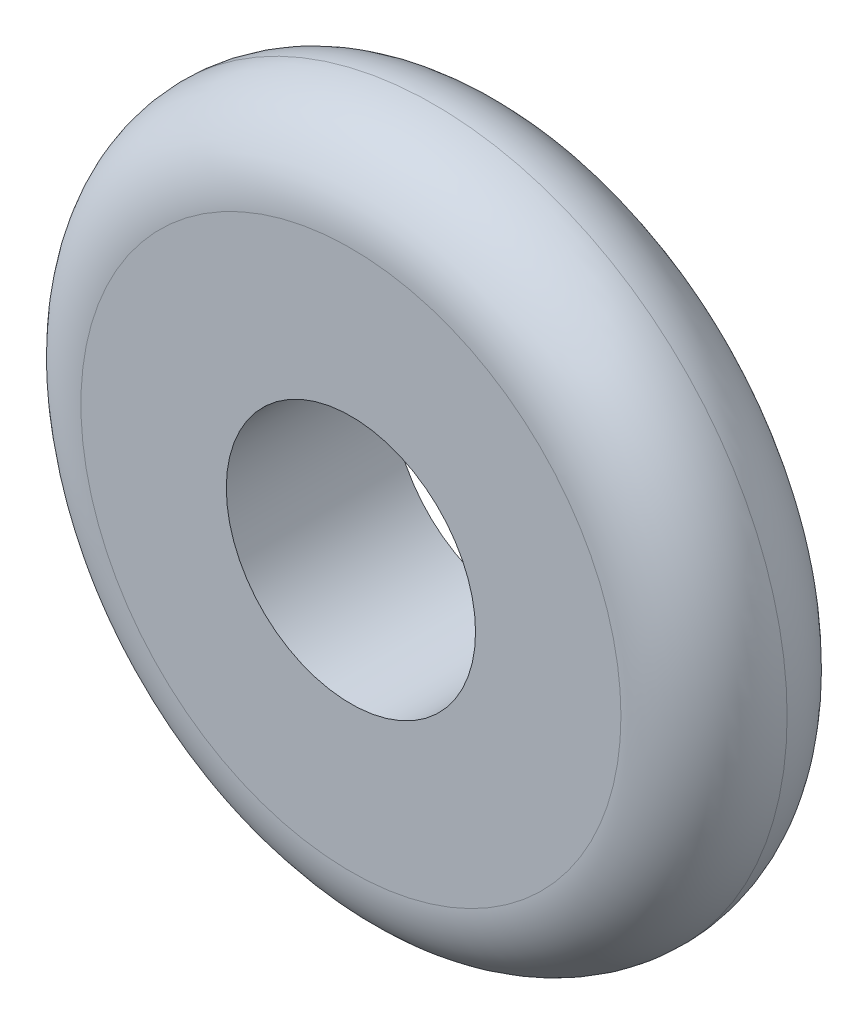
ISO-10303-21;
HEADER;
FILE_DESCRIPTION(('STEP AP214'),'2;1');
FILE_NAME('part.step','',(''),(''),'','','');
FILE_SCHEMA(('AUTOMOTIVE_DESIGN { 1 0 10303 214 1 1 1 1 }'));
ENDSEC;
DATA;
#1=APPLICATION_CONTEXT('core data for automotive mechanical design processes');
#2=APPLICATION_PROTOCOL_DEFINITION('international standard','automotive_design',2000,#1);
#3=PRODUCT_CONTEXT('',#1,'mechanical');
#4=PRODUCT('Part','Part','',(#3));
#5=PRODUCT_RELATED_PRODUCT_CATEGORY('part','',(#4));
#6=PRODUCT_DEFINITION_FORMATION('','',#4);
#7=PRODUCT_DEFINITION_CONTEXT('part definition',#1,'design');
#8=PRODUCT_DEFINITION('design','',#6,#7);
#9=PRODUCT_DEFINITION_SHAPE('','',#8);
#10=(LENGTH_UNIT() NAMED_UNIT(*) SI_UNIT(.MILLI.,.METRE.));
#11=(NAMED_UNIT(*) PLANE_ANGLE_UNIT() SI_UNIT($,.RADIAN.));
#12=(NAMED_UNIT(*) SI_UNIT($,.STERADIAN.) SOLID_ANGLE_UNIT());
#13=UNCERTAINTY_MEASURE_WITH_UNIT(LENGTH_MEASURE(1.E-05),#10,'distance_accuracy_value','');
#14=(GEOMETRIC_REPRESENTATION_CONTEXT(3) GLOBAL_UNCERTAINTY_ASSIGNED_CONTEXT((#13)) GLOBAL_UNIT_ASSIGNED_CONTEXT((#10,
#11,#12)) REPRESENTATION_CONTEXT('',''));
#15=CARTESIAN_POINT('',(0.,0.,0.));
#16=DIRECTION('',(0.,0.,1.));
#17=DIRECTION('',(1.,0.,0.));
#18=AXIS2_PLACEMENT_3D('',#15,#16,#17);
#19=CARTESIAN_POINT('',(0.,0.,4.));
#20=DIRECTION('',(0.,0.,1.));
#21=DIRECTION('',(1.,0.,0.));
#22=AXIS2_PLACEMENT_3D('',#19,#20,#21);
#23=PLANE('',#22);
#24=CARTESIAN_POINT('',(0.,0.,4.));
#25=DIRECTION('',(0.,0.,1.));
#26=DIRECTION('',(1.,0.,0.));
#27=AXIS2_PLACEMENT_3D('',#24,#25,#26);
#28=CIRCLE('',#27,6.5);
#29=CARTESIAN_POINT('',(6.5,0.,4.));
#30=VERTEX_POINT('',#29);
#31=EDGE_CURVE('E10',#30,#30,#28,.T.);
#32=ORIENTED_EDGE('',*,*,#31,.T.);
#33=EDGE_LOOP('',(#32));
#34=FACE_BOUND('',#33,.T.);
#35=CARTESIAN_POINT('',(0.,0.,4.));
#36=DIRECTION('',(0.,0.,1.));
#37=DIRECTION('',(1.,0.,0.));
#38=AXIS2_PLACEMENT_3D('',#35,#36,#37);
#39=CIRCLE('',#38,3.);
#40=CARTESIAN_POINT('',(3.,0.,4.));
#41=VERTEX_POINT('',#40);
#42=EDGE_CURVE('E41',#41,#41,#39,.T.);
#43=ORIENTED_EDGE('',*,*,#42,.F.);
#44=EDGE_LOOP('',(#43));
#45=FACE_BOUND('',#44,.T.);
#46=ADVANCED_FACE('F29',(#34,#45),#23,.T.);
#47=CARTESIAN_POINT('',(0.,0.,0.));
#48=DIRECTION('',(0.,0.,1.));
#49=DIRECTION('',(1.,0.,0.));
#50=AXIS2_PLACEMENT_3D('',#47,#48,#49);
#51=PLANE('',#50);
#52=CARTESIAN_POINT('',(0.,0.,0.));
#53=DIRECTION('',(0.,0.,1.));
#54=DIRECTION('',(1.,0.,0.));
#55=AXIS2_PLACEMENT_3D('',#52,#53,#54);
#56=CIRCLE('',#55,6.5);
#57=CARTESIAN_POINT('',(6.5,0.,0.));
#58=VERTEX_POINT('',#57);
#59=EDGE_CURVE('E37',#58,#58,#56,.F.);
#60=ORIENTED_EDGE('',*,*,#59,.T.);
#61=EDGE_LOOP('',(#60));
#62=FACE_BOUND('',#61,.T.);
#63=CARTESIAN_POINT('',(0.,0.,0.));
#64=DIRECTION('',(0.,0.,1.));
#65=DIRECTION('',(1.,0.,0.));
#66=AXIS2_PLACEMENT_3D('',#63,#64,#65);
#67=CIRCLE('',#66,3.);
#68=CARTESIAN_POINT('',(3.,0.,0.));
#69=VERTEX_POINT('',#68);
#70=EDGE_CURVE('E44',#69,#69,#67,.T.);
#71=ORIENTED_EDGE('',*,*,#70,.T.);
#72=EDGE_LOOP('',(#71));
#73=FACE_BOUND('',#72,.T.);
#74=ADVANCED_FACE('F54',(#62,#73),#51,.F.);
#75=CARTESIAN_POINT('',(0.,0.,4.));
#76=DIRECTION('',(0.,0.,-1.));
#77=DIRECTION('',(-1.,0.,0.));
#78=AXIS2_PLACEMENT_3D('',#75,#76,#77);
#79=CYLINDRICAL_SURFACE('',#78,3.);
#80=ORIENTED_EDGE('',*,*,#42,.T.);
#81=EDGE_LOOP('',(#80));
#82=FACE_BOUND('',#81,.T.);
#83=ORIENTED_EDGE('',*,*,#70,.F.);
#84=EDGE_LOOP('',(#83));
#85=FACE_BOUND('',#84,.T.);
#86=ADVANCED_FACE('F50',(#82,#85),#79,.F.);
#87=CARTESIAN_POINT('',(0.,0.,2.));
#88=DIRECTION('',(0.,0.,1.));
#89=DIRECTION('',(1.,0.,0.));
#90=AXIS2_PLACEMENT_3D('',#87,#88,#89);
#91=TOROIDAL_SURFACE('',#90,6.5,2.);
#92=ORIENTED_EDGE('',*,*,#31,.F.);
#93=EDGE_LOOP('',(#92));
#94=FACE_BOUND('',#93,.T.);
#95=CARTESIAN_POINT('',(0.,0.,2.));
#96=DIRECTION('',(0.,0.,1.));
#97=DIRECTION('',(1.,0.,0.));
#98=AXIS2_PLACEMENT_3D('',#95,#96,#97);
#99=CIRCLE('',#98,8.5);
#100=CARTESIAN_POINT('',(8.5,0.,2.));
#101=VERTEX_POINT('',#100);
#102=EDGE_CURVE('E33',#101,#101,#99,.F.);
#103=ORIENTED_EDGE('',*,*,#102,.F.);
#104=EDGE_LOOP('',(#103));
#105=FACE_BOUND('',#104,.T.);
#106=ADVANCED_FACE('F31',(#94,#105),#91,.T.);
#107=CARTESIAN_POINT('',(0.,0.,2.));
#108=DIRECTION('',(0.,0.,1.));
#109=DIRECTION('',(1.,0.,0.));
#110=AXIS2_PLACEMENT_3D('',#107,#108,#109);
#111=TOROIDAL_SURFACE('',#110,6.5,2.);
#112=ORIENTED_EDGE('',*,*,#59,.F.);
#113=EDGE_LOOP('',(#112));
#114=FACE_BOUND('',#113,.T.);
#115=ORIENTED_EDGE('',*,*,#102,.T.);
#116=EDGE_LOOP('',(#115));
#117=FACE_BOUND('',#116,.T.);
#118=ADVANCED_FACE('F62',(#114,#117),#111,.T.);
#119=CLOSED_SHELL('',(#46,#74,#86,#106,#118));
#120=MANIFOLD_SOLID_BREP('B2',#119);
#121=ADVANCED_BREP_SHAPE_REPRESENTATION('',(#18,#120),#14);
#122=SHAPE_DEFINITION_REPRESENTATION(#9,#121);
ENDSEC;
END-ISO-10303-21;
